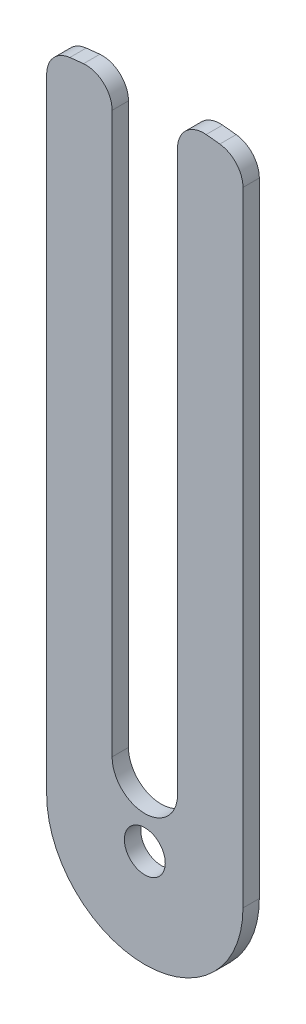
ISO-10303-21;
HEADER;
FILE_DESCRIPTION(('STEP AP214'),'2;1');
FILE_NAME('part.step','',(''),(''),'','','');
FILE_SCHEMA(('AUTOMOTIVE_DESIGN { 1 0 10303 214 1 1 1 1 }'));
ENDSEC;
DATA;
#1=APPLICATION_CONTEXT('core data for automotive mechanical design processes');
#2=APPLICATION_PROTOCOL_DEFINITION('international standard','automotive_design',2000,#1);
#3=PRODUCT_CONTEXT('',#1,'mechanical');
#4=PRODUCT('Part','Part','',(#3));
#5=PRODUCT_RELATED_PRODUCT_CATEGORY('part','',(#4));
#6=PRODUCT_DEFINITION_FORMATION('','',#4);
#7=PRODUCT_DEFINITION_CONTEXT('part definition',#1,'design');
#8=PRODUCT_DEFINITION('design','',#6,#7);
#9=PRODUCT_DEFINITION_SHAPE('','',#8);
#10=(LENGTH_UNIT() NAMED_UNIT(*) SI_UNIT(.MILLI.,.METRE.));
#11=(NAMED_UNIT(*) PLANE_ANGLE_UNIT() SI_UNIT($,.RADIAN.));
#12=(NAMED_UNIT(*) SI_UNIT($,.STERADIAN.) SOLID_ANGLE_UNIT());
#13=UNCERTAINTY_MEASURE_WITH_UNIT(LENGTH_MEASURE(1.E-05),#10,'distance_accuracy_value','');
#14=(GEOMETRIC_REPRESENTATION_CONTEXT(3) GLOBAL_UNCERTAINTY_ASSIGNED_CONTEXT((#13)) GLOBAL_UNIT_ASSIGNED_CONTEXT((#10,
#11,#12)) REPRESENTATION_CONTEXT('',''));
#15=CARTESIAN_POINT('',(0.,0.,0.));
#16=DIRECTION('',(0.,0.,1.));
#17=DIRECTION('',(1.,0.,0.));
#18=AXIS2_PLACEMENT_3D('',#15,#16,#17);
#19=CARTESIAN_POINT('',(-6.35,0.,3.175));
#20=DIRECTION('',(1.,0.,0.));
#21=DIRECTION('',(0.,1.,0.));
#22=AXIS2_PLACEMENT_3D('',#19,#20,#21);
#23=PLANE('',#22);
#24=DIRECTION('',(0.,-1.,0.));
#25=VECTOR('',#24,1.);
#26=CARTESIAN_POINT('',(-6.35,0.,0.));
#27=LINE('',#26,#25);
#28=CARTESIAN_POINT('',(-6.35000000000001,121.383036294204,0.));
#29=VERTEX_POINT('',#28);
#30=CARTESIAN_POINT('',(-6.35,12.7,0.));
#31=VERTEX_POINT('',#30);
#32=EDGE_CURVE('E163',#29,#31,#27,.T.);
#33=ORIENTED_EDGE('',*,*,#32,.F.);
#34=DIRECTION('',(0.,0.,1.));
#35=VECTOR('',#34,1.);
#36=CARTESIAN_POINT('',(-6.35000000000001,121.383036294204,3.175));
#37=LINE('',#36,#35);
#38=CARTESIAN_POINT('',(-6.35000000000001,121.383036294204,3.175));
#39=VERTEX_POINT('',#38);
#40=EDGE_CURVE('E41',#29,#39,#37,.T.);
#41=ORIENTED_EDGE('',*,*,#40,.T.);
#42=DIRECTION('',(0.,-1.,0.));
#43=VECTOR('',#42,1.);
#44=CARTESIAN_POINT('',(-6.35,0.,3.175));
#45=LINE('',#44,#43);
#46=CARTESIAN_POINT('',(-6.35,12.7,3.175));
#47=VERTEX_POINT('',#46);
#48=EDGE_CURVE('E147',#39,#47,#45,.T.);
#49=ORIENTED_EDGE('',*,*,#48,.T.);
#50=DIRECTION('',(0.,0.,-1.));
#51=VECTOR('',#50,1.);
#52=CARTESIAN_POINT('',(-6.35,12.7,3.175));
#53=LINE('',#52,#51);
#54=EDGE_CURVE('E159',#47,#31,#53,.T.);
#55=ORIENTED_EDGE('',*,*,#54,.T.);
#56=EDGE_LOOP('',(#33,#41,#49,#55));
#57=FACE_BOUND('',#56,.T.);
#58=ADVANCED_FACE('F33',(#57),#23,.T.);
#59=CARTESIAN_POINT('',(0.,0.,3.175));
#60=DIRECTION('',(0.,0.,-1.));
#61=DIRECTION('',(-1.,0.,0.));
#62=AXIS2_PLACEMENT_3D('',#59,#60,#61);
#63=CYLINDRICAL_SURFACE('',#62,127.);
#64=CARTESIAN_POINT('',(0.,0.,3.175));
#65=DIRECTION('',(0.,0.,1.));
#66=DIRECTION('',(1.,0.,0.));
#67=AXIS2_PLACEMENT_3D('',#64,#65,#66);
#68=CIRCLE('',#67,127.);
#69=CARTESIAN_POINT('',(-11.90625,126.440662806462,3.175));
#70=VERTEX_POINT('',#69);
#71=CARTESIAN_POINT('',(-14.5520833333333,126.16353225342,3.175));
#72=VERTEX_POINT('',#71);
#73=EDGE_CURVE('E145',#70,#72,#68,.T.);
#74=ORIENTED_EDGE('',*,*,#73,.F.);
#75=DIRECTION('',(0.,0.,-1.));
#76=VECTOR('',#75,1.);
#77=CARTESIAN_POINT('',(-11.90625,126.440662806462,3.175));
#78=LINE('',#77,#76);
#79=CARTESIAN_POINT('',(-11.90625,126.440662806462,0.));
#80=VERTEX_POINT('',#79);
#81=EDGE_CURVE('E214',#70,#80,#78,.T.);
#82=ORIENTED_EDGE('',*,*,#81,.T.);
#83=CARTESIAN_POINT('',(0.,0.,0.));
#84=DIRECTION('',(0.,0.,1.));
#85=DIRECTION('',(1.,0.,0.));
#86=AXIS2_PLACEMENT_3D('',#83,#84,#85);
#87=CIRCLE('',#86,127.);
#88=CARTESIAN_POINT('',(-14.5520833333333,126.16353225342,0.));
#89=VERTEX_POINT('',#88);
#90=EDGE_CURVE('E165',#80,#89,#87,.T.);
#91=ORIENTED_EDGE('',*,*,#90,.T.);
#92=DIRECTION('',(0.,0.,-1.));
#93=VECTOR('',#92,1.);
#94=CARTESIAN_POINT('',(-14.5520833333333,126.16353225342,3.175));
#95=LINE('',#94,#93);
#96=EDGE_CURVE('E212',#89,#72,#95,.F.);
#97=ORIENTED_EDGE('',*,*,#96,.T.);
#98=EDGE_LOOP('',(#74,#82,#91,#97));
#99=FACE_BOUND('',#98,.T.);
#100=ADVANCED_FACE('F229',(#99),#63,.T.);
#101=CARTESIAN_POINT('',(-19.05,0.,3.175));
#102=DIRECTION('',(-1.,0.,0.));
#103=DIRECTION('',(0.,0.,1.));
#104=AXIS2_PLACEMENT_3D('',#101,#102,#103);
#105=PLANE('',#104);
#106=DIRECTION('',(0.,1.,0.));
#107=VECTOR('',#106,1.);
#108=CARTESIAN_POINT('',(-19.05,0.,3.175));
#109=LINE('',#108,#107);
#110=CARTESIAN_POINT('',(-19.05,0.,3.175));
#111=VERTEX_POINT('',#110);
#112=CARTESIAN_POINT('',(-19.05,121.116990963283,3.175));
#113=VERTEX_POINT('',#112);
#114=EDGE_CURVE('E126',#111,#113,#109,.T.);
#115=ORIENTED_EDGE('',*,*,#114,.T.);
#116=DIRECTION('',(0.,0.,1.));
#117=VECTOR('',#116,1.);
#118=CARTESIAN_POINT('',(-19.05,121.116990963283,0.));
#119=LINE('',#118,#117);
#120=CARTESIAN_POINT('',(-19.05,121.116990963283,0.));
#121=VERTEX_POINT('',#120);
#122=EDGE_CURVE('E11',#113,#121,#119,.F.);
#123=ORIENTED_EDGE('',*,*,#122,.T.);
#124=DIRECTION('',(0.,1.,0.));
#125=VECTOR('',#124,1.);
#126=CARTESIAN_POINT('',(-19.05,0.,0.));
#127=LINE('',#126,#125);
#128=CARTESIAN_POINT('',(-19.05,0.,0.));
#129=VERTEX_POINT('',#128);
#130=EDGE_CURVE('E129',#129,#121,#127,.T.);
#131=ORIENTED_EDGE('',*,*,#130,.F.);
#132=DIRECTION('',(0.,0.,-1.));
#133=VECTOR('',#132,1.);
#134=CARTESIAN_POINT('',(-19.05,0.,3.175));
#135=LINE('',#134,#133);
#136=EDGE_CURVE('E123',#111,#129,#135,.T.);
#137=ORIENTED_EDGE('',*,*,#136,.F.);
#138=EDGE_LOOP('',(#115,#123,#131,#137));
#139=FACE_BOUND('',#138,.T.);
#140=ADVANCED_FACE('F125',(#139),#105,.T.);
#141=CARTESIAN_POINT('',(0.,0.,3.175));
#142=DIRECTION('',(0.,0.,-1.));
#143=DIRECTION('',(-1.,0.,0.));
#144=AXIS2_PLACEMENT_3D('',#141,#142,#143);
#145=CYLINDRICAL_SURFACE('',#144,19.05);
#146=CARTESIAN_POINT('',(0.,0.,0.));
#147=DIRECTION('',(0.,0.,1.));
#148=DIRECTION('',(1.,0.,0.));
#149=AXIS2_PLACEMENT_3D('',#146,#147,#148);
#150=CIRCLE('',#149,19.05);
#151=CARTESIAN_POINT('',(19.05,0.,0.));
#152=VERTEX_POINT('',#151);
#153=EDGE_CURVE('E169',#129,#152,#150,.T.);
#154=ORIENTED_EDGE('',*,*,#153,.T.);
#155=DIRECTION('',(0.,0.,-1.));
#156=VECTOR('',#155,1.);
#157=CARTESIAN_POINT('',(19.05,0.,3.175));
#158=LINE('',#157,#156);
#159=CARTESIAN_POINT('',(19.05,0.,3.175));
#160=VERTEX_POINT('',#159);
#161=EDGE_CURVE('E134',#160,#152,#158,.T.);
#162=ORIENTED_EDGE('',*,*,#161,.F.);
#163=CARTESIAN_POINT('',(0.,0.,3.175));
#164=DIRECTION('',(0.,0.,1.));
#165=DIRECTION('',(1.,0.,0.));
#166=AXIS2_PLACEMENT_3D('',#163,#164,#165);
#167=CIRCLE('',#166,19.05);
#168=EDGE_CURVE('E138',#111,#160,#167,.T.);
#169=ORIENTED_EDGE('',*,*,#168,.F.);
#170=ORIENTED_EDGE('',*,*,#136,.T.);
#171=EDGE_LOOP('',(#154,#162,#169,#170));
#172=FACE_BOUND('',#171,.T.);
#173=ADVANCED_FACE('F139',(#172),#145,.T.);
#174=CARTESIAN_POINT('',(19.05,0.,3.175));
#175=DIRECTION('',(-1.,0.,0.));
#176=DIRECTION('',(0.,0.,1.));
#177=AXIS2_PLACEMENT_3D('',#174,#175,#176);
#178=PLANE('',#177);
#179=DIRECTION('',(0.,1.,0.));
#180=VECTOR('',#179,1.);
#181=CARTESIAN_POINT('',(19.05,0.,0.));
#182=LINE('',#181,#180);
#183=CARTESIAN_POINT('',(19.05,121.116990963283,0.));
#184=VERTEX_POINT('',#183);
#185=EDGE_CURVE('E171',#152,#184,#182,.T.);
#186=ORIENTED_EDGE('',*,*,#185,.T.);
#187=DIRECTION('',(0.,0.,-1.));
#188=VECTOR('',#187,1.);
#189=CARTESIAN_POINT('',(19.05,121.116990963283,3.175));
#190=LINE('',#189,#188);
#191=CARTESIAN_POINT('',(19.05,121.116990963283,3.175));
#192=VERTEX_POINT('',#191);
#193=EDGE_CURVE('E201',#184,#192,#190,.F.);
#194=ORIENTED_EDGE('',*,*,#193,.T.);
#195=DIRECTION('',(0.,1.,0.));
#196=VECTOR('',#195,1.);
#197=CARTESIAN_POINT('',(19.05,0.,3.175));
#198=LINE('',#197,#196);
#199=EDGE_CURVE('E142',#160,#192,#198,.T.);
#200=ORIENTED_EDGE('',*,*,#199,.F.);
#201=ORIENTED_EDGE('',*,*,#161,.T.);
#202=EDGE_LOOP('',(#186,#194,#200,#201));
#203=FACE_BOUND('',#202,.T.);
#204=ADVANCED_FACE('F283',(#203),#178,.F.);
#205=CARTESIAN_POINT('',(0.,0.,3.175));
#206=DIRECTION('',(0.,0.,-1.));
#207=DIRECTION('',(-1.,0.,0.));
#208=AXIS2_PLACEMENT_3D('',#205,#206,#207);
#209=CYLINDRICAL_SURFACE('',#208,127.);
#210=CARTESIAN_POINT('',(0.,0.,3.175));
#211=DIRECTION('',(0.,0.,1.));
#212=DIRECTION('',(1.,0.,0.));
#213=AXIS2_PLACEMENT_3D('',#210,#211,#212);
#214=CIRCLE('',#213,127.);
#215=CARTESIAN_POINT('',(14.5520833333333,126.16353225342,3.175));
#216=VERTEX_POINT('',#215);
#217=CARTESIAN_POINT('',(11.90625,126.440662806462,3.175));
#218=VERTEX_POINT('',#217);
#219=EDGE_CURVE('E152',#216,#218,#214,.T.);
#220=ORIENTED_EDGE('',*,*,#219,.F.);
#221=DIRECTION('',(0.,0.,-1.));
#222=VECTOR('',#221,1.);
#223=CARTESIAN_POINT('',(14.5520833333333,126.16353225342,3.175));
#224=LINE('',#223,#222);
#225=CARTESIAN_POINT('',(14.5520833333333,126.16353225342,0.));
#226=VERTEX_POINT('',#225);
#227=EDGE_CURVE('E190',#216,#226,#224,.T.);
#228=ORIENTED_EDGE('',*,*,#227,.T.);
#229=CARTESIAN_POINT('',(0.,0.,0.));
#230=DIRECTION('',(0.,0.,1.));
#231=DIRECTION('',(1.,0.,0.));
#232=AXIS2_PLACEMENT_3D('',#229,#230,#231);
#233=CIRCLE('',#232,127.);
#234=CARTESIAN_POINT('',(11.90625,126.440662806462,0.));
#235=VERTEX_POINT('',#234);
#236=EDGE_CURVE('E174',#226,#235,#233,.T.);
#237=ORIENTED_EDGE('',*,*,#236,.T.);
#238=DIRECTION('',(0.,0.,-1.));
#239=VECTOR('',#238,1.);
#240=CARTESIAN_POINT('',(11.90625,126.440662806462,3.175));
#241=LINE('',#240,#239);
#242=EDGE_CURVE('E133',#235,#218,#241,.F.);
#243=ORIENTED_EDGE('',*,*,#242,.T.);
#244=EDGE_LOOP('',(#220,#228,#237,#243));
#245=FACE_BOUND('',#244,.T.);
#246=ADVANCED_FACE('F280',(#245),#209,.T.);
#247=CARTESIAN_POINT('',(6.35,0.,3.175));
#248=DIRECTION('',(1.,0.,0.));
#249=DIRECTION('',(0.,1.,0.));
#250=AXIS2_PLACEMENT_3D('',#247,#248,#249);
#251=PLANE('',#250);
#252=DIRECTION('',(0.,-1.,0.));
#253=VECTOR('',#252,1.);
#254=CARTESIAN_POINT('',(6.35,0.,3.175));
#255=LINE('',#254,#253);
#256=CARTESIAN_POINT('',(6.35000000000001,121.383036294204,3.175));
#257=VERTEX_POINT('',#256);
#258=CARTESIAN_POINT('',(6.35,12.7,3.175));
#259=VERTEX_POINT('',#258);
#260=EDGE_CURVE('E154',#257,#259,#255,.T.);
#261=ORIENTED_EDGE('',*,*,#260,.F.);
#262=DIRECTION('',(0.,0.,-1.));
#263=VECTOR('',#262,1.);
#264=CARTESIAN_POINT('',(6.35000000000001,121.383036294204,3.175));
#265=LINE('',#264,#263);
#266=CARTESIAN_POINT('',(6.35000000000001,121.383036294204,0.));
#267=VERTEX_POINT('',#266);
#268=EDGE_CURVE('E209',#257,#267,#265,.T.);
#269=ORIENTED_EDGE('',*,*,#268,.T.);
#270=DIRECTION('',(0.,-1.,0.));
#271=VECTOR('',#270,1.);
#272=CARTESIAN_POINT('',(6.35,0.,0.));
#273=LINE('',#272,#271);
#274=CARTESIAN_POINT('',(6.35,12.7,0.));
#275=VERTEX_POINT('',#274);
#276=EDGE_CURVE('E177',#267,#275,#273,.T.);
#277=ORIENTED_EDGE('',*,*,#276,.T.);
#278=DIRECTION('',(0.,0.,-1.));
#279=VECTOR('',#278,1.);
#280=CARTESIAN_POINT('',(6.35,12.7,3.175));
#281=LINE('',#280,#279);
#282=EDGE_CURVE('E185',#259,#275,#281,.T.);
#283=ORIENTED_EDGE('',*,*,#282,.F.);
#284=EDGE_LOOP('',(#261,#269,#277,#283));
#285=FACE_BOUND('',#284,.T.);
#286=ADVANCED_FACE('F252',(#285),#251,.F.);
#287=CARTESIAN_POINT('',(0.,0.,3.175));
#288=DIRECTION('',(0.,0.,-1.));
#289=DIRECTION('',(-1.,0.,0.));
#290=AXIS2_PLACEMENT_3D('',#287,#288,#289);
#291=CYLINDRICAL_SURFACE('',#290,3.96875);
#292=CARTESIAN_POINT('',(0.,0.,3.175));
#293=DIRECTION('',(0.,0.,1.));
#294=DIRECTION('',(1.,0.,0.));
#295=AXIS2_PLACEMENT_3D('',#292,#293,#294);
#296=CIRCLE('',#295,3.96875);
#297=CARTESIAN_POINT('',(3.96875,0.,3.175));
#298=VERTEX_POINT('',#297);
#299=EDGE_CURVE('E182',#298,#298,#296,.T.);
#300=ORIENTED_EDGE('',*,*,#299,.T.);
#301=EDGE_LOOP('',(#300));
#302=FACE_BOUND('',#301,.T.);
#303=CARTESIAN_POINT('',(0.,0.,0.));
#304=DIRECTION('',(0.,0.,1.));
#305=DIRECTION('',(1.,0.,0.));
#306=AXIS2_PLACEMENT_3D('',#303,#304,#305);
#307=CIRCLE('',#306,3.96875);
#308=CARTESIAN_POINT('',(3.96875,0.,0.));
#309=VERTEX_POINT('',#308);
#310=EDGE_CURVE('E160',#309,#309,#307,.T.);
#311=ORIENTED_EDGE('',*,*,#310,.F.);
#312=EDGE_LOOP('',(#311));
#313=FACE_BOUND('',#312,.T.);
#314=ADVANCED_FACE('F248',(#302,#313),#291,.F.);
#315=CARTESIAN_POINT('',(0.,12.7,3.175));
#316=DIRECTION('',(0.,0.,-1.));
#317=DIRECTION('',(-1.,0.,0.));
#318=AXIS2_PLACEMENT_3D('',#315,#316,#317);
#319=CYLINDRICAL_SURFACE('',#318,6.35);
#320=CARTESIAN_POINT('',(0.,12.7,0.));
#321=DIRECTION('',(0.,0.,1.));
#322=DIRECTION('',(1.,0.,0.));
#323=AXIS2_PLACEMENT_3D('',#320,#321,#322);
#324=CIRCLE('',#323,6.35);
#325=EDGE_CURVE('E179',#31,#275,#324,.T.);
#326=ORIENTED_EDGE('',*,*,#325,.F.);
#327=ORIENTED_EDGE('',*,*,#54,.F.);
#328=CARTESIAN_POINT('',(0.,12.7,3.175));
#329=DIRECTION('',(0.,0.,1.));
#330=DIRECTION('',(1.,0.,0.));
#331=AXIS2_PLACEMENT_3D('',#328,#329,#330);
#332=CIRCLE('',#331,6.35);
#333=EDGE_CURVE('E156',#47,#259,#332,.T.);
#334=ORIENTED_EDGE('',*,*,#333,.T.);
#335=ORIENTED_EDGE('',*,*,#282,.T.);
#336=EDGE_LOOP('',(#326,#327,#334,#335));
#337=FACE_BOUND('',#336,.T.);
#338=ADVANCED_FACE('F251',(#337),#319,.F.);
#339=CARTESIAN_POINT('',(0.,0.,3.175));
#340=DIRECTION('',(0.,0.,1.));
#341=DIRECTION('',(1.,0.,0.));
#342=AXIS2_PLACEMENT_3D('',#339,#340,#341);
#343=PLANE('',#342);
#344=ORIENTED_EDGE('',*,*,#299,.F.);
#345=EDGE_LOOP('',(#344));
#346=FACE_BOUND('',#345,.T.);
#347=ORIENTED_EDGE('',*,*,#199,.T.);
#348=CARTESIAN_POINT('',(13.97,121.116990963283,3.175));
#349=DIRECTION('',(0.,0.,1.));
#350=DIRECTION('',(1.,0.,0.));
#351=AXIS2_PLACEMENT_3D('',#348,#349,#350);
#352=CIRCLE('',#351,5.08);
#353=EDGE_CURVE('E207',#192,#216,#352,.T.);
#354=ORIENTED_EDGE('',*,*,#353,.T.);
#355=ORIENTED_EDGE('',*,*,#219,.T.);
#356=CARTESIAN_POINT('',(11.43,121.383036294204,3.175));
#357=DIRECTION('',(0.,0.,1.));
#358=DIRECTION('',(1.,0.,0.));
#359=AXIS2_PLACEMENT_3D('',#356,#357,#358);
#360=CIRCLE('',#359,5.08);
#361=EDGE_CURVE('E48',#218,#257,#360,.T.);
#362=ORIENTED_EDGE('',*,*,#361,.T.);
#363=ORIENTED_EDGE('',*,*,#260,.T.);
#364=ORIENTED_EDGE('',*,*,#333,.F.);
#365=ORIENTED_EDGE('',*,*,#48,.F.);
#366=CARTESIAN_POINT('',(-11.43,121.383036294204,3.175));
#367=DIRECTION('',(0.,0.,1.));
#368=DIRECTION('',(1.,0.,0.));
#369=AXIS2_PLACEMENT_3D('',#366,#367,#368);
#370=CIRCLE('',#369,5.08);
#371=EDGE_CURVE('E204',#39,#70,#370,.T.);
#372=ORIENTED_EDGE('',*,*,#371,.T.);
#373=ORIENTED_EDGE('',*,*,#73,.T.);
#374=CARTESIAN_POINT('',(-13.97,121.116990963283,3.175));
#375=DIRECTION('',(0.,0.,1.));
#376=DIRECTION('',(1.,0.,0.));
#377=AXIS2_PLACEMENT_3D('',#374,#375,#376);
#378=CIRCLE('',#377,5.08);
#379=EDGE_CURVE('E55',#72,#113,#378,.T.);
#380=ORIENTED_EDGE('',*,*,#379,.T.);
#381=ORIENTED_EDGE('',*,*,#114,.F.);
#382=ORIENTED_EDGE('',*,*,#168,.T.);
#383=EDGE_LOOP('',(#347,#354,#355,#362,#363,#364,#365,#372,#373,#380,#381,#382));
#384=FACE_BOUND('',#383,.T.);
#385=ADVANCED_FACE('F144',(#346,#384),#343,.T.);
#386=CARTESIAN_POINT('',(0.,0.,0.));
#387=DIRECTION('',(0.,0.,1.));
#388=DIRECTION('',(1.,0.,0.));
#389=AXIS2_PLACEMENT_3D('',#386,#387,#388);
#390=PLANE('',#389);
#391=ORIENTED_EDGE('',*,*,#310,.T.);
#392=EDGE_LOOP('',(#391));
#393=FACE_BOUND('',#392,.T.);
#394=ORIENTED_EDGE('',*,*,#236,.F.);
#395=CARTESIAN_POINT('',(13.97,121.116990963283,0.));
#396=DIRECTION('',(0.,0.,1.));
#397=DIRECTION('',(1.,0.,0.));
#398=AXIS2_PLACEMENT_3D('',#395,#396,#397);
#399=CIRCLE('',#398,5.08);
#400=EDGE_CURVE('E199',#226,#184,#399,.F.);
#401=ORIENTED_EDGE('',*,*,#400,.T.);
#402=ORIENTED_EDGE('',*,*,#185,.F.);
#403=ORIENTED_EDGE('',*,*,#153,.F.);
#404=ORIENTED_EDGE('',*,*,#130,.T.);
#405=CARTESIAN_POINT('',(-13.97,121.116990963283,0.));
#406=DIRECTION('',(0.,0.,1.));
#407=DIRECTION('',(1.,0.,0.));
#408=AXIS2_PLACEMENT_3D('',#405,#406,#407);
#409=CIRCLE('',#408,5.08);
#410=EDGE_CURVE('E193',#121,#89,#409,.F.);
#411=ORIENTED_EDGE('',*,*,#410,.T.);
#412=ORIENTED_EDGE('',*,*,#90,.F.);
#413=CARTESIAN_POINT('',(-11.43,121.383036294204,0.));
#414=DIRECTION('',(0.,0.,1.));
#415=DIRECTION('',(1.,0.,0.));
#416=AXIS2_PLACEMENT_3D('',#413,#414,#415);
#417=CIRCLE('',#416,5.08);
#418=EDGE_CURVE('E195',#80,#29,#417,.F.);
#419=ORIENTED_EDGE('',*,*,#418,.T.);
#420=ORIENTED_EDGE('',*,*,#32,.T.);
#421=ORIENTED_EDGE('',*,*,#325,.T.);
#422=ORIENTED_EDGE('',*,*,#276,.F.);
#423=CARTESIAN_POINT('',(11.43,121.383036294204,0.));
#424=DIRECTION('',(0.,0.,1.));
#425=DIRECTION('',(1.,0.,0.));
#426=AXIS2_PLACEMENT_3D('',#423,#424,#425);
#427=CIRCLE('',#426,5.08);
#428=EDGE_CURVE('E197',#267,#235,#427,.F.);
#429=ORIENTED_EDGE('',*,*,#428,.T.);
#430=EDGE_LOOP('',(#394,#401,#402,#403,#404,#411,#412,#419,#420,#421,#422,#429));
#431=FACE_BOUND('',#430,.T.);
#432=ADVANCED_FACE('F233',(#393,#431),#390,.F.);
#433=CARTESIAN_POINT('',(13.97,121.116990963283,3.175));
#434=DIRECTION('',(0.,0.,-1.));
#435=DIRECTION('',(-1.,0.,0.));
#436=AXIS2_PLACEMENT_3D('',#433,#434,#435);
#437=CYLINDRICAL_SURFACE('',#436,5.08);
#438=ORIENTED_EDGE('',*,*,#353,.F.);
#439=ORIENTED_EDGE('',*,*,#193,.F.);
#440=ORIENTED_EDGE('',*,*,#400,.F.);
#441=ORIENTED_EDGE('',*,*,#227,.F.);
#442=EDGE_LOOP('',(#438,#439,#440,#441));
#443=FACE_BOUND('',#442,.T.);
#444=ADVANCED_FACE('F254',(#443),#437,.T.);
#445=CARTESIAN_POINT('',(11.43,121.383036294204,3.175));
#446=DIRECTION('',(0.,0.,-1.));
#447=DIRECTION('',(-1.,0.,0.));
#448=AXIS2_PLACEMENT_3D('',#445,#446,#447);
#449=CYLINDRICAL_SURFACE('',#448,5.08);
#450=ORIENTED_EDGE('',*,*,#361,.F.);
#451=ORIENTED_EDGE('',*,*,#242,.F.);
#452=ORIENTED_EDGE('',*,*,#428,.F.);
#453=ORIENTED_EDGE('',*,*,#268,.F.);
#454=EDGE_LOOP('',(#450,#451,#452,#453));
#455=FACE_BOUND('',#454,.T.);
#456=ADVANCED_FACE('F239',(#455),#449,.T.);
#457=CARTESIAN_POINT('',(-11.43,121.383036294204,3.175));
#458=DIRECTION('',(0.,0.,-1.));
#459=DIRECTION('',(-1.,0.,0.));
#460=AXIS2_PLACEMENT_3D('',#457,#458,#459);
#461=CYLINDRICAL_SURFACE('',#460,5.08);
#462=ORIENTED_EDGE('',*,*,#371,.F.);
#463=ORIENTED_EDGE('',*,*,#40,.F.);
#464=ORIENTED_EDGE('',*,*,#418,.F.);
#465=ORIENTED_EDGE('',*,*,#81,.F.);
#466=EDGE_LOOP('',(#462,#463,#464,#465));
#467=FACE_BOUND('',#466,.T.);
#468=ADVANCED_FACE('F226',(#467),#461,.T.);
#469=CARTESIAN_POINT('',(-13.97,121.116990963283,3.175));
#470=DIRECTION('',(0.,0.,-1.));
#471=DIRECTION('',(-1.,0.,0.));
#472=AXIS2_PLACEMENT_3D('',#469,#470,#471);
#473=CYLINDRICAL_SURFACE('',#472,5.08);
#474=ORIENTED_EDGE('',*,*,#379,.F.);
#475=ORIENTED_EDGE('',*,*,#96,.F.);
#476=ORIENTED_EDGE('',*,*,#410,.F.);
#477=ORIENTED_EDGE('',*,*,#122,.F.);
#478=EDGE_LOOP('',(#474,#475,#476,#477));
#479=FACE_BOUND('',#478,.T.);
#480=ADVANCED_FACE('F35',(#479),#473,.T.);
#481=CLOSED_SHELL('',(#58,#100,#140,#173,#204,#246,#286,#314,#338,#385,#432,#444,#456,#468,#480));
#482=MANIFOLD_SOLID_BREP('B2',#481);
#483=ADVANCED_BREP_SHAPE_REPRESENTATION('',(#18,#482),#14);
#484=SHAPE_DEFINITION_REPRESENTATION(#9,#483);
ENDSEC;
END-ISO-10303-21;
